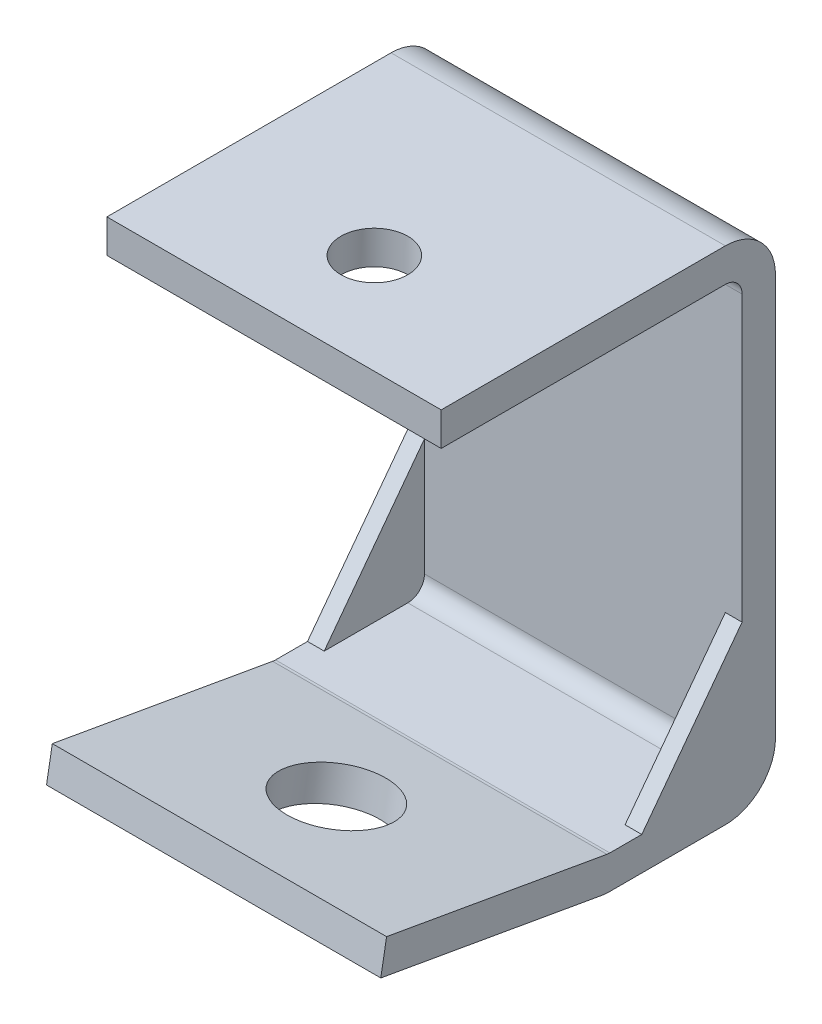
from build123d import *

# Parameters (mm, degrees)
BASE_EXTRUDE_THIN_DEPTH = 31.75
CUT_EXTRUDE1_REACH      = 123.615
SKETCH2_R               = 6.35
BOSS_EXTRUDE1_DEPTH     = 3.175
SKETCH4_R               = 9.525
CUT_EXTRUDE2_DEPTH      = 120.613937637


with BuildPart() as part:
    # Sketch1 → Base-Extrude-Thin (new, symmetric)
    with BuildSketch(Plane(origin=(0, 0, 0), x_dir=(0, 0, -1), z_dir=(1, 0, 0))):
        with BuildLine():
            Line((-67.523772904, 7.427557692), (-25.673556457, 0.048235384))
            ThreePointArc((-25.673556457, 0.048235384), (-25.398942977, 0.012081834), (-25.122223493, 0))
            Line((-25.122223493, 0), (-3.175, 0))
            ThreePointArc((-3.175, 0), (-0.92993597, 0.92993597), (0, 3.175))
            Line((0, 3.175), (0, 79.375))
            ThreePointArc((0, 79.375), (-0.92993597, 81.62006403), (-3.175, 82.55))
            Line((-3.175, 82.55), (-57.15, 82.55))
            Line((-57.15, 82.55), (-57.15, 88.9))
            Line((-57.15, 88.9), (-3.175, 88.9))
            ThreePointArc((-3.175, 88.9), (3.560192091, 86.110192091), (6.35, 79.375))
            Line((6.35, 79.375), (6.35, 3.175))
            ThreePointArc((6.35, 3.175), (3.560192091, -3.560192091), (-3.175, -6.35))
            Line((-3.175, -6.35), (-25.122223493, -6.35))
            ThreePointArc((-25.122223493, -6.35), (-25.952381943, -6.313754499), (-26.776222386, -6.205293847))
            Line((-26.776222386, -6.205293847), (-68.626438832, 1.174028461))
            Line((-68.626438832, 1.174028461), (-67.523772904, 7.427557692))
        make_face()
    extrude(amount=BASE_EXTRUDE_THIN_DEPTH, both=True)

    # Sketch2 → Cut-Extrude1 (cut, up to next)
    with BuildSketch(Plane(origin=(0, 88.9, 0), x_dir=(-1, 0, 0), z_dir=(0, 1, 0)), mode=Mode.PRIVATE) as cut_extrude1_sk1:
        with Locations(Location((0, 38.1, 0), (0, 0, 90))):
            Circle(SKETCH2_R)
    cut_extrude1_tool1 = extrude(cut_extrude1_sk1.sketch, amount=-CUT_EXTRUDE1_REACH, mode=Mode.PRIVATE) & part.part
    add(cut_extrude1_tool1.solids().sort_by_distance((0, 88.9, 38.1))[0], mode=Mode.SUBTRACT)

    # Sketch3 → Boss-Extrude1 (add)
    with BuildSketch(Plane(origin=(31.75, 0, 0), x_dir=(0, 0, -1), z_dir=(1, 0, 0))):
        with BuildLine():
            Line((-19.05, 0), (-3.175, 0))
            ThreePointArc((-3.175, 0), (-0.92993597, 0.92993597), (0, 3.175))
            Line((0, 3.175), (0, 25.4))
            Line((0, 25.4), (-19.05, 0))
        make_face()
    boss_extrude1 = extrude(amount=-BOSS_EXTRUDE1_DEPTH)

    # Mirror1: Boss-Extrude1 across plane
    add(boss_extrude1.mirror(Plane(origin=(0, 0, 0), x_dir=(0, 0, 1), z_dir=(1, 0, 0))))

    # Sketch4 → Cut-Extrude2 (cut, through all)
    with BuildSketch(Plane(origin=(0, -4.34365582, 0.765903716), x_dir=(-1, 0, 0), z_dir=(0, 0.984807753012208, -0.17364817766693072))):
        with Locations(Location((0, 45.239836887, 0), (0, 0, 90))):
            Circle(SKETCH4_R)
    extrude(amount=-CUT_EXTRUDE2_DEPTH, mode=Mode.SUBTRACT)


solid = part.part
